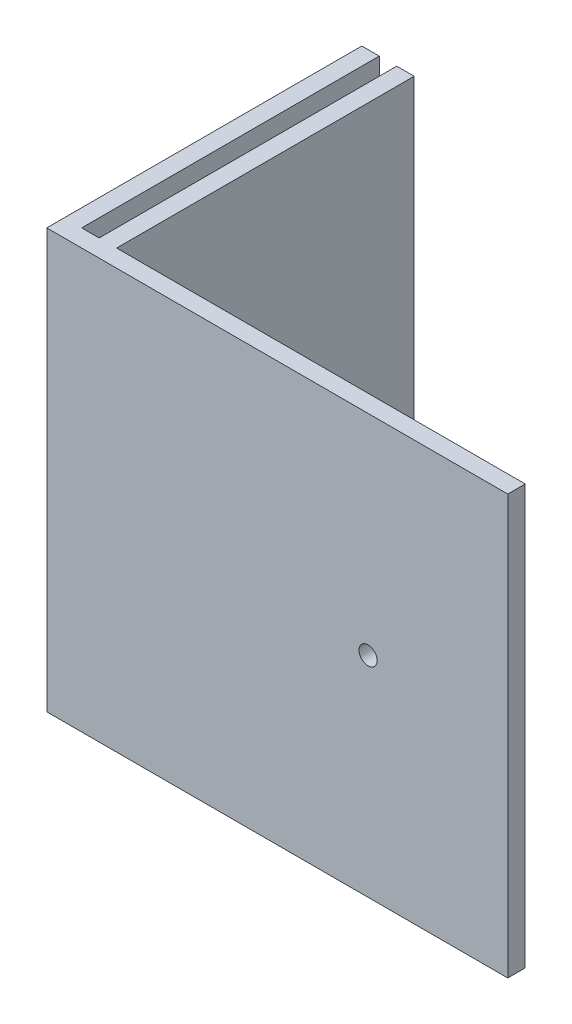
from build123d import *

# Parameters (mm, degrees)
SKETCH1_W           = 83.82
SKETCH1_H           = 76.2
SKETCH1_R           = 1.651
BOSS_EXTRUDE1_DEPTH = 3.175
SKETCH2_W           = 3.175
SKETCH2_H           = 76.2
BOSS_EXTRUDE2_DEPTH = 57.277


with BuildPart() as part:
    # Sketch1 → Boss-Extrude1 (new body)
    with BuildSketch(Plane.XY):
        with Locations((-41.91, 38.1)):
            Rectangle(SKETCH1_W, SKETCH1_H)
        with Locations((-25.4, 38.1)):
            Circle(SKETCH1_R, mode=Mode.SUBTRACT)
    extrude(amount=BOSS_EXTRUDE1_DEPTH)

    # Sketch2 → Boss-Extrude2 (add)
    with BuildSketch(Plane.XY.offset(3.175)):
        with Locations((-82.2325, 38.1)):
            Rectangle(SKETCH2_W, SKETCH2_H)
        with Locations((-75.8825, 38.1)):
            Rectangle(SKETCH2_W, SKETCH2_H)
    extrude(amount=-BOSS_EXTRUDE2_DEPTH)


solid = part.part
